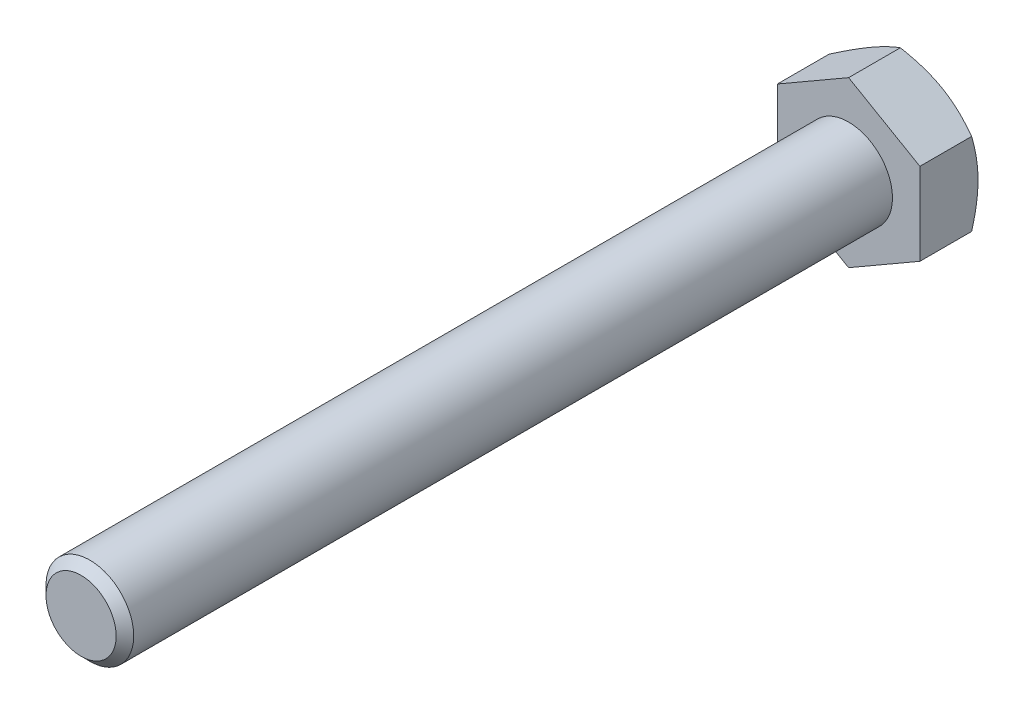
from build123d import *

# Parameters (mm, degrees)
ESQUISSE1_W        = 4
ESQUISSE1_H        = 70
CHANFREIN1_SIZE    = 0.8
BOSS_EXTRU_1_DEPTH = 5.3


with BuildPart() as part:
    # Esquisse1 → Base-R_volution (revolve)
    with BuildSketch(Plane(origin=(0, 0, 0), x_dir=(1, 0, 0), z_dir=(0, 1, 0))):
        with Locations((2, -35)):
            Rectangle(ESQUISSE1_W, ESQUISSE1_H)
    revolve(axis=Axis((0, 0, 0), (0, 0, 1)))

    # Chanfrein1
    chanfrein1_edges = [part.edges().sort_by_distance(p)[0] for p in [
        (-4, 0, 70),
    ]]
    chamfer(chanfrein1_edges, length=CHANFREIN1_SIZE)

    # Esquisse6 → Boss.-Extru.1 (add)
    with BuildSketch(Plane.XY):
        Polygon((6.5, -3.75277675), (6.5, 3.75277675), (0, 7.505553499), (-6.5, 3.75277675), (-6.5, -3.75277675), (0, -7.505553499), align=None)
    extrude(amount=-BOSS_EXTRU_1_DEPTH)

    # Esquisse7 → Enl_vement de mati_re-R_volution1 (revolve, cut)
    with BuildSketch(Plane(origin=(0, 0, 0), x_dir=(1, 0, 0), z_dir=(0, 1, 0))):
        Polygon((-6.5, 5.3), (-15.67986928, 5.3), (-15.67986928, 0), align=None)
    revolve(axis=Axis((0, 0, -6.239446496), (0, 0, 1)), mode=Mode.SUBTRACT)


solid = part.part
